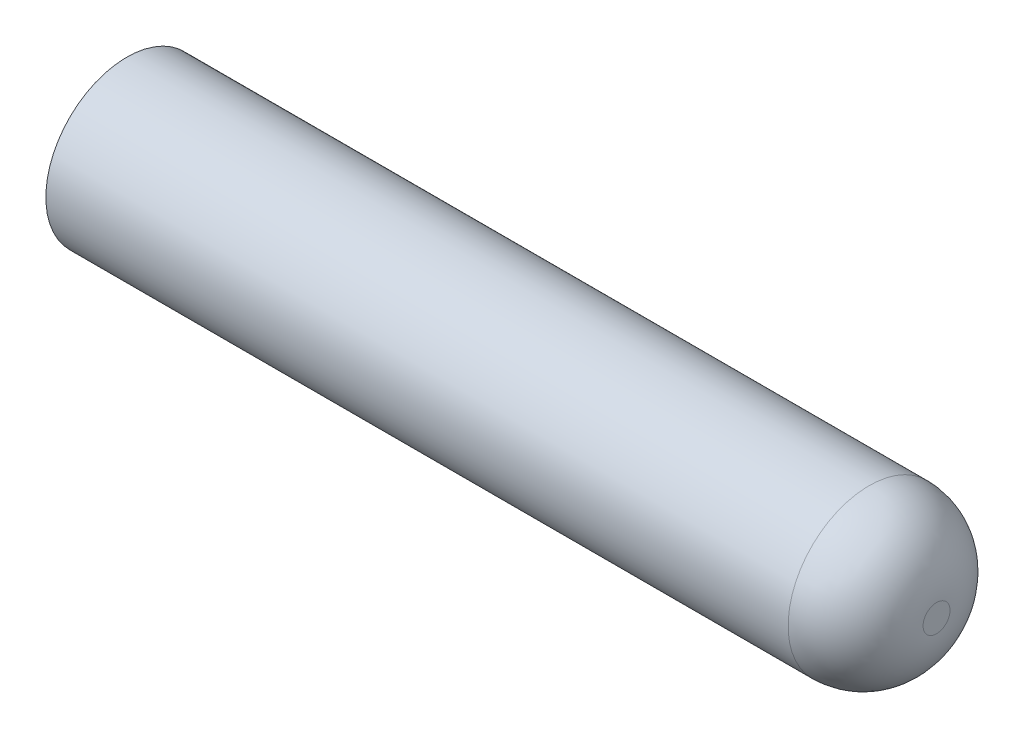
ISO-10303-21;
HEADER;
FILE_DESCRIPTION(('STEP AP214'),'2;1');
FILE_NAME('part.step','',(''),(''),'','','');
FILE_SCHEMA(('AUTOMOTIVE_DESIGN { 1 0 10303 214 1 1 1 1 }'));
ENDSEC;
DATA;
#1=APPLICATION_CONTEXT('core data for automotive mechanical design processes');
#2=APPLICATION_PROTOCOL_DEFINITION('international standard','automotive_design',2000,#1);
#3=PRODUCT_CONTEXT('',#1,'mechanical');
#4=PRODUCT('Part','Part','',(#3));
#5=PRODUCT_RELATED_PRODUCT_CATEGORY('part','',(#4));
#6=PRODUCT_DEFINITION_FORMATION('','',#4);
#7=PRODUCT_DEFINITION_CONTEXT('part definition',#1,'design');
#8=PRODUCT_DEFINITION('design','',#6,#7);
#9=PRODUCT_DEFINITION_SHAPE('','',#8);
#10=(LENGTH_UNIT() NAMED_UNIT(*) SI_UNIT(.MILLI.,.METRE.));
#11=(NAMED_UNIT(*) PLANE_ANGLE_UNIT() SI_UNIT($,.RADIAN.));
#12=(NAMED_UNIT(*) SI_UNIT($,.STERADIAN.) SOLID_ANGLE_UNIT());
#13=UNCERTAINTY_MEASURE_WITH_UNIT(LENGTH_MEASURE(1.E-05),#10,'distance_accuracy_value','');
#14=(GEOMETRIC_REPRESENTATION_CONTEXT(3) GLOBAL_UNCERTAINTY_ASSIGNED_CONTEXT((#13)) GLOBAL_UNIT_ASSIGNED_CONTEXT((#10,
#11,#12)) REPRESENTATION_CONTEXT('',''));
#15=CARTESIAN_POINT('',(0.,0.,0.));
#16=DIRECTION('',(0.,0.,1.));
#17=DIRECTION('',(1.,0.,0.));
#18=AXIS2_PLACEMENT_3D('',#15,#16,#17);
#19=CARTESIAN_POINT('',(30.,0.,0.));
#20=DIRECTION('',(-1.,0.,0.));
#21=DIRECTION('',(0.,0.,1.));
#22=AXIS2_PLACEMENT_3D('',#19,#20,#21);
#23=CYLINDRICAL_SURFACE('',#22,3.);
#24=CARTESIAN_POINT('',(27.5,0.,0.));
#25=DIRECTION('',(1.,0.,0.));
#26=DIRECTION('',(0.,0.,-1.));
#27=AXIS2_PLACEMENT_3D('',#24,#25,#26);
#28=CIRCLE('',#27,3.);
#29=CARTESIAN_POINT('',(27.5,0.,-3.));
#30=VERTEX_POINT('',#29);
#31=EDGE_CURVE('E10',#30,#30,#28,.F.);
#32=ORIENTED_EDGE('',*,*,#31,.T.);
#33=EDGE_LOOP('',(#32));
#34=FACE_BOUND('',#33,.T.);
#35=CARTESIAN_POINT('',(0.,0.,0.));
#36=DIRECTION('',(1.,0.,0.));
#37=DIRECTION('',(0.,0.,-1.));
#38=AXIS2_PLACEMENT_3D('',#35,#36,#37);
#39=CIRCLE('',#38,3.);
#40=CARTESIAN_POINT('',(0.,0.,-3.));
#41=VERTEX_POINT('',#40);
#42=EDGE_CURVE('E42',#41,#41,#39,.T.);
#43=ORIENTED_EDGE('',*,*,#42,.T.);
#44=EDGE_LOOP('',(#43));
#45=FACE_BOUND('',#44,.T.);
#46=ADVANCED_FACE('F31',(#34,#45),#23,.T.);
#47=CARTESIAN_POINT('',(30.,0.,0.));
#48=DIRECTION('',(1.,0.,0.));
#49=DIRECTION('',(0.,0.,-1.));
#50=AXIS2_PLACEMENT_3D('',#47,#48,#49);
#51=PLANE('',#50);
#52=CARTESIAN_POINT('',(30.,0.,0.));
#53=DIRECTION('',(1.,0.,0.));
#54=DIRECTION('',(0.,0.,-1.));
#55=AXIS2_PLACEMENT_3D('',#52,#53,#54);
#56=CIRCLE('',#55,0.5);
#57=CARTESIAN_POINT('',(30.,0.,-0.5));
#58=VERTEX_POINT('',#57);
#59=EDGE_CURVE('E38',#58,#58,#56,.T.);
#60=ORIENTED_EDGE('',*,*,#59,.T.);
#61=EDGE_LOOP('',(#60));
#62=FACE_BOUND('',#61,.T.);
#63=ADVANCED_FACE('F66',(#62),#51,.T.);
#64=CARTESIAN_POINT('',(0.,0.,0.));
#65=DIRECTION('',(1.,0.,0.));
#66=DIRECTION('',(0.,0.,-1.));
#67=AXIS2_PLACEMENT_3D('',#64,#65,#66);
#68=PLANE('',#67);
#69=CARTESIAN_POINT('',(0.,0.,0.));
#70=DIRECTION('',(-1.,0.,0.));
#71=DIRECTION('',(0.,0.,1.));
#72=AXIS2_PLACEMENT_3D('',#69,#70,#71);
#73=CIRCLE('',#72,1.5);
#74=CARTESIAN_POINT('',(0.,0.,1.5));
#75=VERTEX_POINT('',#74);
#76=EDGE_CURVE('E49',#75,#75,#73,.T.);
#77=ORIENTED_EDGE('',*,*,#76,.F.);
#78=EDGE_LOOP('',(#77));
#79=FACE_BOUND('',#78,.T.);
#80=ORIENTED_EDGE('',*,*,#42,.F.);
#81=EDGE_LOOP('',(#80));
#82=FACE_BOUND('',#81,.T.);
#83=ADVANCED_FACE('F63',(#79,#82),#68,.F.);
#84=CARTESIAN_POINT('',(27.5,0.,0.));
#85=DIRECTION('',(1.,0.,0.));
#86=DIRECTION('',(0.,0.,-1.));
#87=AXIS2_PLACEMENT_3D('',#84,#85,#86);
#88=DEGENERATE_TOROIDAL_SURFACE('',#87,0.5,2.5,.T.);
#89=ORIENTED_EDGE('',*,*,#31,.F.);
#90=EDGE_LOOP('',(#89));
#91=FACE_BOUND('',#90,.T.);
#92=ORIENTED_EDGE('',*,*,#59,.F.);
#93=EDGE_LOOP('',(#92));
#94=FACE_BOUND('',#93,.T.);
#95=ADVANCED_FACE('F33',(#91,#94),#88,.T.);
#96=CARTESIAN_POINT('',(10.,0.,0.));
#97=DIRECTION('',(-1.,0.,0.));
#98=DIRECTION('',(0.,0.,1.));
#99=AXIS2_PLACEMENT_3D('',#96,#97,#98);
#100=CYLINDRICAL_SURFACE('',#99,1.5);
#101=CARTESIAN_POINT('',(10.,0.,0.));
#102=DIRECTION('',(-1.,0.,0.));
#103=DIRECTION('',(0.,0.,1.));
#104=AXIS2_PLACEMENT_3D('',#101,#102,#103);
#105=CIRCLE('',#104,1.5);
#106=CARTESIAN_POINT('',(10.,0.,1.5));
#107=VERTEX_POINT('',#106);
#108=EDGE_CURVE('E46',#107,#107,#105,.T.);
#109=ORIENTED_EDGE('',*,*,#108,.F.);
#110=EDGE_LOOP('',(#109));
#111=FACE_BOUND('',#110,.T.);
#112=ORIENTED_EDGE('',*,*,#76,.T.);
#113=EDGE_LOOP('',(#112));
#114=FACE_BOUND('',#113,.T.);
#115=ADVANCED_FACE('F57',(#111,#114),#100,.F.);
#116=CARTESIAN_POINT('',(10.,0.,0.));
#117=DIRECTION('',(-1.,0.,0.));
#118=DIRECTION('',(0.,0.,1.));
#119=AXIS2_PLACEMENT_3D('',#116,#117,#118);
#120=PLANE('',#119);
#121=ORIENTED_EDGE('',*,*,#108,.T.);
#122=EDGE_LOOP('',(#121));
#123=FACE_BOUND('',#122,.T.);
#124=ADVANCED_FACE('F55',(#123),#120,.T.);
#125=CLOSED_SHELL('',(#46,#63,#83,#95,#115,#124));
#126=MANIFOLD_SOLID_BREP('B2',#125);
#127=ADVANCED_BREP_SHAPE_REPRESENTATION('',(#18,#126),#14);
#128=SHAPE_DEFINITION_REPRESENTATION(#9,#127);
ENDSEC;
END-ISO-10303-21;
